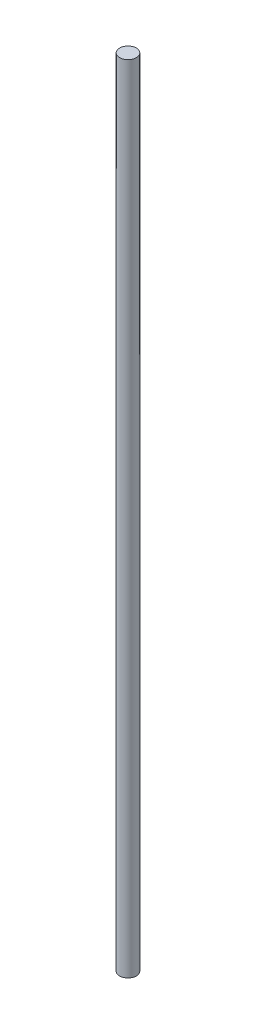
from build123d import *

# Parameters (mm, degrees)
SKETCH1_R           = 4
BOSS_EXTRUDE1_DEPTH = 381


with BuildPart() as part:
    # Sketch1 → Boss-Extrude1 (new body)
    with BuildSketch(Plane(origin=(0, 0, 0), x_dir=(1, 0, 0), z_dir=(0, 1, 0))):
        with Locations(Location((0, 0, 0), (0, 0, 270))):
            Circle(SKETCH1_R)
    extrude(amount=BOSS_EXTRUDE1_DEPTH)


solid = part.part
